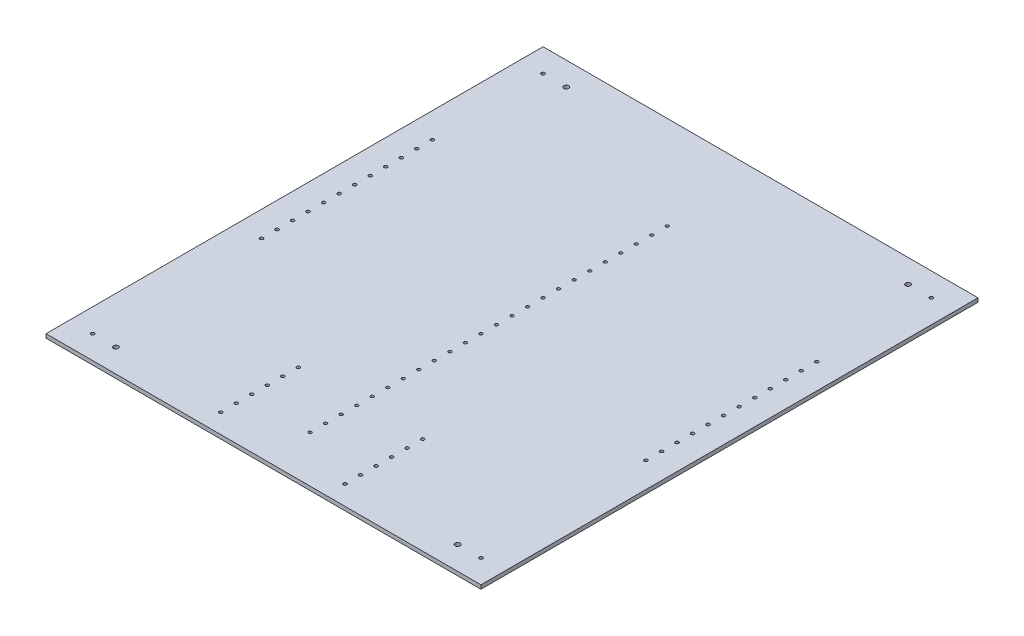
from build123d import *

# Parameters (mm, degrees)
SKETCH1_W                      = 711.2
SKETCH1_H                      = 812.8
BOSS_EXTRUDE1_DEPTH            = 6.35
F_10_CLEARANCE_HOLE1_D         = 5.6134
F_1_4_28_TAPPED_HOLE1_D        = 5.4102
LPATTERN1_COUNT                = 12
LPATTERN1_PITCH                = 25.4
F_1_4_28_TAPPED_HOLE2_D        = 5.4102
LPATTERN2_COUNT                = 6
LPATTERN2_PITCH                = 25.4
F_5_16_0_3125_DIAMETER_HOLE1_D = 7.9375
F_1_4_20_TAPPED_HOLE1_D        = 5.1054
LPATTERN3_COUNT                = 24
LPATTERN3_PITCH                = 25.4


with BuildPart() as part:
    # Sketch1 → Boss-Extrude1 (new body)
    with BuildSketch(Plane(origin=(0, 0, 0), x_dir=(1, 0, 0), z_dir=(0, 1, 0))):
        Rectangle(SKETCH1_W, SKETCH1_H)
    extrude(amount=BOSS_EXTRUDE1_DEPTH)

    # 10 Clearance Hole1 (through all)
    with Locations(Plane(origin=(0, 6.35, 0), x_dir=(1, 0, 0), z_dir=(0, 1, 0))):
        with Locations((-317.5, 368.3), (317.5, 368.3), (317.5, -368.3), (-317.5, -368.3)):
            Hole(F_10_CLEARANCE_HOLE1_D / 2)

    # 1_4-28 Tapped Hole1 (through all)
    with Locations(Plane(origin=(0, 6.35, 0), x_dir=(1, 0, 0), z_dir=(0, 1, 0))):
        with Locations((-314.325, 184.15), (314.325, 184.15)):
            f_1_4_28_tapped_hole1 = Hole(F_1_4_28_TAPPED_HOLE1_D / 2)

    # LPattern1: 1_4-28 Tapped Hole1 ×12
    with Locations(*[(0, 0, i * LPATTERN1_PITCH) for i in range(1, LPATTERN1_COUNT)]):
        add(f_1_4_28_tapped_hole1, mode=Mode.SUBTRACT)

    # 1_4-28 Tapped Hole2 (through all)
    with Locations(Plane(origin=(0, 6.35, 0), x_dir=(1, 0, 0), z_dir=(0, 1, 0))):
        with Locations((-101.6, -247.65), (101.6, -247.65)):
            f_1_4_28_tapped_hole2 = Hole(F_1_4_28_TAPPED_HOLE2_D / 2)

    # LPattern2: 1_4-28 Tapped Hole2 ×6
    with Locations(*[(0, 0, i * LPATTERN2_PITCH) for i in range(1, LPATTERN2_COUNT)]):
        add(f_1_4_28_tapped_hole2, mode=Mode.SUBTRACT)

    # 5_16 _0.3125_ Diameter Hole1 (through all)
    with Locations(Plane(origin=(0, 6.35, 0), x_dir=(1, 0, 0), z_dir=(0, 1, 0))):
        with Locations((-279.4, 368.3), (279.4, 368.3), (279.4, -368.3), (-279.4, -368.3)):
            Hole(F_5_16_0_3125_DIAMETER_HOLE1_D / 2)

    # 1_4-20 Tapped Hole1 (through all)
    with Locations(Plane(origin=(0, 6.35, 0), x_dir=(1, 0, 0), z_dir=(0, 1, 0))):
        with Locations((0, 254)):
            f_1_4_20_tapped_hole1 = Hole(F_1_4_20_TAPPED_HOLE1_D / 2)

    # LPattern3: 1_4-20 Tapped Hole1 ×24
    with Locations(*[(0, 0, i * LPATTERN3_PITCH) for i in range(1, LPATTERN3_COUNT)]):
        add(f_1_4_20_tapped_hole1, mode=Mode.SUBTRACT)


solid = part.part
